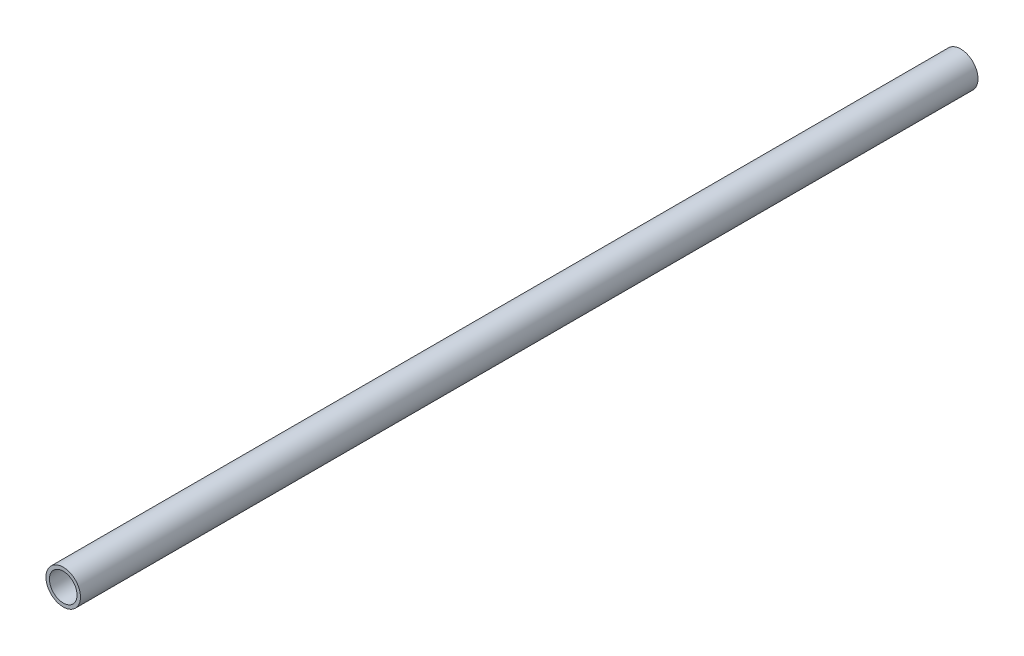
ISO-10303-21;
HEADER;
FILE_DESCRIPTION(('STEP AP214'),'2;1');
FILE_NAME('part.step','',(''),(''),'','','');
FILE_SCHEMA(('AUTOMOTIVE_DESIGN { 1 0 10303 214 1 1 1 1 }'));
ENDSEC;
DATA;
#1=APPLICATION_CONTEXT('core data for automotive mechanical design processes');
#2=APPLICATION_PROTOCOL_DEFINITION('international standard','automotive_design',2000,#1);
#3=PRODUCT_CONTEXT('',#1,'mechanical');
#4=PRODUCT('Part','Part','',(#3));
#5=PRODUCT_RELATED_PRODUCT_CATEGORY('part','',(#4));
#6=PRODUCT_DEFINITION_FORMATION('','',#4);
#7=PRODUCT_DEFINITION_CONTEXT('part definition',#1,'design');
#8=PRODUCT_DEFINITION('design','',#6,#7);
#9=PRODUCT_DEFINITION_SHAPE('','',#8);
#10=(LENGTH_UNIT() NAMED_UNIT(*) SI_UNIT(.MILLI.,.METRE.));
#11=(NAMED_UNIT(*) PLANE_ANGLE_UNIT() SI_UNIT($,.RADIAN.));
#12=(NAMED_UNIT(*) SI_UNIT($,.STERADIAN.) SOLID_ANGLE_UNIT());
#13=UNCERTAINTY_MEASURE_WITH_UNIT(LENGTH_MEASURE(1.E-05),#10,'distance_accuracy_value','');
#14=(GEOMETRIC_REPRESENTATION_CONTEXT(3) GLOBAL_UNCERTAINTY_ASSIGNED_CONTEXT((#13)) GLOBAL_UNIT_ASSIGNED_CONTEXT((#10,
#11,#12)) REPRESENTATION_CONTEXT('',''));
#15=CARTESIAN_POINT('',(0.,0.,0.));
#16=DIRECTION('',(0.,0.,1.));
#17=DIRECTION('',(1.,0.,0.));
#18=AXIS2_PLACEMENT_3D('',#15,#16,#17);
#19=CARTESIAN_POINT('',(0.,0.,1300.));
#20=DIRECTION('',(0.,0.,1.));
#21=DIRECTION('',(1.,0.,0.));
#22=AXIS2_PLACEMENT_3D('',#19,#20,#21);
#23=PLANE('',#22);
#24=CARTESIAN_POINT('',(0.,0.,1300.));
#25=DIRECTION('',(0.,0.,1.));
#26=DIRECTION('',(1.,0.,0.));
#27=AXIS2_PLACEMENT_3D('',#24,#25,#26);
#28=CIRCLE('',#27,25.);
#29=CARTESIAN_POINT('',(25.,0.,1300.));
#30=VERTEX_POINT('',#29);
#31=EDGE_CURVE('E10',#30,#30,#28,.T.);
#32=ORIENTED_EDGE('',*,*,#31,.T.);
#33=EDGE_LOOP('',(#32));
#34=FACE_BOUND('',#33,.T.);
#35=CARTESIAN_POINT('',(0.,0.,1300.));
#36=DIRECTION('',(0.,0.,1.));
#37=DIRECTION('',(1.,0.,0.));
#38=AXIS2_PLACEMENT_3D('',#35,#36,#37);
#39=CIRCLE('',#38,20.);
#40=CARTESIAN_POINT('',(20.,0.,1300.));
#41=VERTEX_POINT('',#40);
#42=EDGE_CURVE('E42',#41,#41,#39,.T.);
#43=ORIENTED_EDGE('',*,*,#42,.F.);
#44=EDGE_LOOP('',(#43));
#45=FACE_BOUND('',#44,.T.);
#46=ADVANCED_FACE('F31',(#34,#45),#23,.T.);
#47=CARTESIAN_POINT('',(0.,0.,0.));
#48=DIRECTION('',(0.,0.,1.));
#49=DIRECTION('',(1.,0.,0.));
#50=AXIS2_PLACEMENT_3D('',#47,#48,#49);
#51=PLANE('',#50);
#52=CARTESIAN_POINT('',(0.,0.,0.));
#53=DIRECTION('',(0.,0.,1.));
#54=DIRECTION('',(1.,0.,0.));
#55=AXIS2_PLACEMENT_3D('',#52,#53,#54);
#56=CIRCLE('',#55,25.);
#57=CARTESIAN_POINT('',(25.,0.,0.));
#58=VERTEX_POINT('',#57);
#59=EDGE_CURVE('E35',#58,#58,#56,.T.);
#60=ORIENTED_EDGE('',*,*,#59,.F.);
#61=EDGE_LOOP('',(#60));
#62=FACE_BOUND('',#61,.T.);
#63=CARTESIAN_POINT('',(0.,0.,0.));
#64=DIRECTION('',(0.,0.,1.));
#65=DIRECTION('',(1.,0.,0.));
#66=AXIS2_PLACEMENT_3D('',#63,#64,#65);
#67=CIRCLE('',#66,20.);
#68=CARTESIAN_POINT('',(20.,0.,0.));
#69=VERTEX_POINT('',#68);
#70=EDGE_CURVE('E44',#69,#69,#67,.T.);
#71=ORIENTED_EDGE('',*,*,#70,.T.);
#72=EDGE_LOOP('',(#71));
#73=FACE_BOUND('',#72,.T.);
#74=ADVANCED_FACE('F54',(#62,#73),#51,.F.);
#75=CARTESIAN_POINT('',(0.,0.,1300.));
#76=DIRECTION('',(0.,0.,-1.));
#77=DIRECTION('',(-1.,0.,0.));
#78=AXIS2_PLACEMENT_3D('',#75,#76,#77);
#79=CYLINDRICAL_SURFACE('',#78,25.);
#80=ORIENTED_EDGE('',*,*,#31,.F.);
#81=EDGE_LOOP('',(#80));
#82=FACE_BOUND('',#81,.T.);
#83=ORIENTED_EDGE('',*,*,#59,.T.);
#84=EDGE_LOOP('',(#83));
#85=FACE_BOUND('',#84,.T.);
#86=ADVANCED_FACE('F33',(#82,#85),#79,.T.);
#87=CARTESIAN_POINT('',(0.,0.,1300.));
#88=DIRECTION('',(0.,0.,-1.));
#89=DIRECTION('',(-1.,0.,0.));
#90=AXIS2_PLACEMENT_3D('',#87,#88,#89);
#91=CYLINDRICAL_SURFACE('',#90,20.);
#92=ORIENTED_EDGE('',*,*,#42,.T.);
#93=EDGE_LOOP('',(#92));
#94=FACE_BOUND('',#93,.T.);
#95=ORIENTED_EDGE('',*,*,#70,.F.);
#96=EDGE_LOOP('',(#95));
#97=FACE_BOUND('',#96,.T.);
#98=ADVANCED_FACE('F50',(#94,#97),#91,.F.);
#99=CLOSED_SHELL('',(#46,#74,#86,#98));
#100=MANIFOLD_SOLID_BREP('B2',#99);
#101=ADVANCED_BREP_SHAPE_REPRESENTATION('',(#18,#100),#14);
#102=SHAPE_DEFINITION_REPRESENTATION(#9,#101);
ENDSEC;
END-ISO-10303-21;
